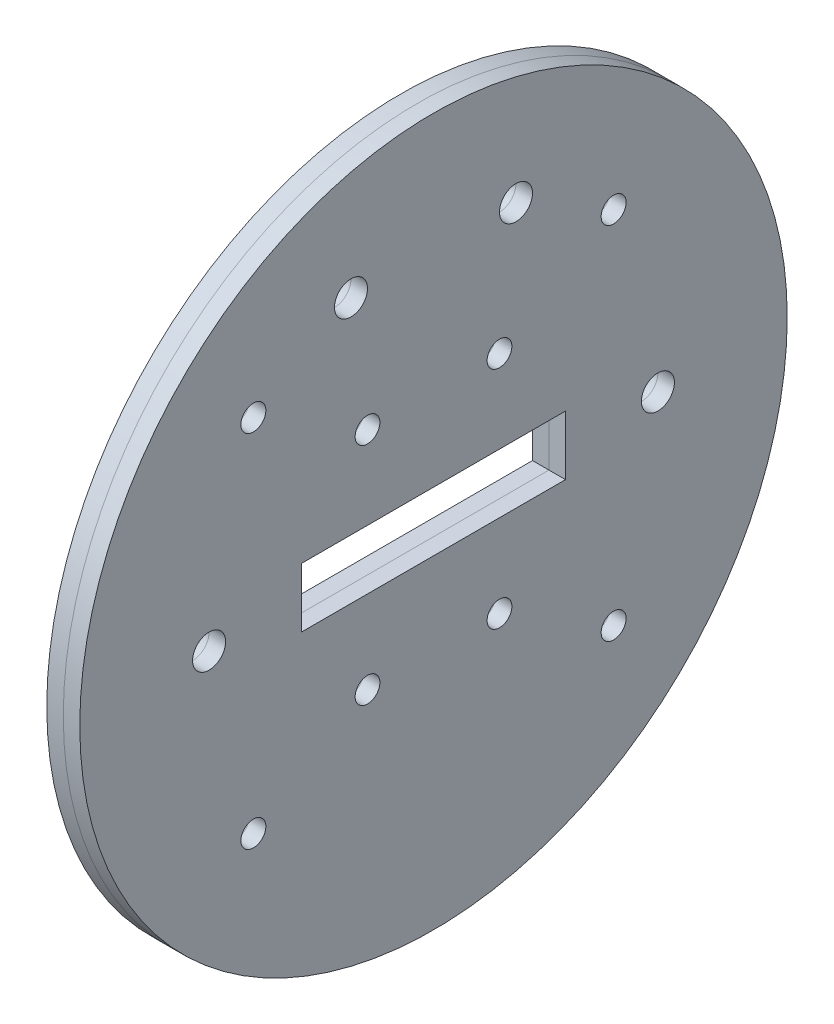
ISO-10303-21;
HEADER;
FILE_DESCRIPTION(('STEP AP214'),'2;1');
FILE_NAME('part.step','',(''),(''),'','','');
FILE_SCHEMA(('AUTOMOTIVE_DESIGN { 1 0 10303 214 1 1 1 1 }'));
ENDSEC;
DATA;
#1=APPLICATION_CONTEXT('core data for automotive mechanical design processes');
#2=APPLICATION_PROTOCOL_DEFINITION('international standard','automotive_design',2000,#1);
#3=PRODUCT_CONTEXT('',#1,'mechanical');
#4=PRODUCT('Part','Part','',(#3));
#5=PRODUCT_RELATED_PRODUCT_CATEGORY('part','',(#4));
#6=PRODUCT_DEFINITION_FORMATION('','',#4);
#7=PRODUCT_DEFINITION_CONTEXT('part definition',#1,'design');
#8=PRODUCT_DEFINITION('design','',#6,#7);
#9=PRODUCT_DEFINITION_SHAPE('','',#8);
#10=(LENGTH_UNIT() NAMED_UNIT(*) SI_UNIT(.MILLI.,.METRE.));
#11=(NAMED_UNIT(*) PLANE_ANGLE_UNIT() SI_UNIT($,.RADIAN.));
#12=(NAMED_UNIT(*) SI_UNIT($,.STERADIAN.) SOLID_ANGLE_UNIT());
#13=UNCERTAINTY_MEASURE_WITH_UNIT(LENGTH_MEASURE(1.E-05),#10,'distance_accuracy_value','');
#14=(GEOMETRIC_REPRESENTATION_CONTEXT(3) GLOBAL_UNCERTAINTY_ASSIGNED_CONTEXT((#13)) GLOBAL_UNIT_ASSIGNED_CONTEXT((#10,
#11,#12)) REPRESENTATION_CONTEXT('',''));
#15=CARTESIAN_POINT('',(0.,0.,0.));
#16=DIRECTION('',(0.,0.,1.));
#17=DIRECTION('',(1.,0.,0.));
#18=AXIS2_PLACEMENT_3D('',#15,#16,#17);
#19=CARTESIAN_POINT('',(6.35,0.,0.));
#20=DIRECTION('',(-1.,0.,0.));
#21=DIRECTION('',(0.,0.,1.));
#22=AXIS2_PLACEMENT_3D('',#19,#20,#21);
#23=CYLINDRICAL_SURFACE('',#22,68.072);
#24=CARTESIAN_POINT('',(6.35,0.,0.));
#25=DIRECTION('',(1.,0.,0.));
#26=DIRECTION('',(0.,0.,-1.));
#27=AXIS2_PLACEMENT_3D('',#24,#25,#26);
#28=CIRCLE('',#27,68.072);
#29=CARTESIAN_POINT('',(6.35,0.,-68.072));
#30=VERTEX_POINT('',#29);
#31=EDGE_CURVE('E140',#30,#30,#28,.T.);
#32=ORIENTED_EDGE('',*,*,#31,.F.);
#33=EDGE_LOOP('',(#32));
#34=FACE_BOUND('',#33,.T.);
#35=CARTESIAN_POINT('',(3.175,0.,0.));
#36=DIRECTION('',(1.,0.,0.));
#37=DIRECTION('',(0.,0.,-1.));
#38=AXIS2_PLACEMENT_3D('',#35,#36,#37);
#39=CIRCLE('',#38,68.072);
#40=CARTESIAN_POINT('',(3.175,0.,-68.072));
#41=VERTEX_POINT('',#40);
#42=EDGE_CURVE('E145',#41,#41,#39,.T.);
#43=ORIENTED_EDGE('',*,*,#42,.T.);
#44=EDGE_LOOP('',(#43));
#45=FACE_BOUND('',#44,.T.);
#46=ADVANCED_FACE('F53',(#34,#45),#23,.T.);
#47=CARTESIAN_POINT('',(6.35,0.,0.));
#48=DIRECTION('',(1.,0.,0.));
#49=DIRECTION('',(0.,0.,-1.));
#50=AXIS2_PLACEMENT_3D('',#47,#48,#49);
#51=PLANE('',#50);
#52=CARTESIAN_POINT('',(6.35,-34.6637886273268,34.6637886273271));
#53=DIRECTION('',(1.,0.,0.));
#54=DIRECTION('',(0.,0.,-1.));
#55=AXIS2_PLACEMENT_3D('',#52,#53,#54);
#56=CIRCLE('',#55,2.40029999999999);
#57=CARTESIAN_POINT('',(6.35,-34.6637886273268,32.2634886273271));
#58=VERTEX_POINT('',#57);
#59=EDGE_CURVE('E195',#58,#58,#56,.T.);
#60=ORIENTED_EDGE('',*,*,#59,.F.);
#61=EDGE_LOOP('',(#60));
#62=FACE_BOUND('',#61,.T.);
#63=CARTESIAN_POINT('',(6.35,34.6637886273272,34.6637886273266));
#64=DIRECTION('',(1.,0.,0.));
#65=DIRECTION('',(0.,0.,-1.));
#66=AXIS2_PLACEMENT_3D('',#63,#64,#65);
#67=CIRCLE('',#66,2.40029999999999);
#68=CARTESIAN_POINT('',(6.35,34.6637886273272,32.2634886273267));
#69=VERTEX_POINT('',#68);
#70=EDGE_CURVE('E242',#69,#69,#67,.T.);
#71=ORIENTED_EDGE('',*,*,#70,.F.);
#72=EDGE_LOOP('',(#71));
#73=FACE_BOUND('',#72,.T.);
#74=CARTESIAN_POINT('',(6.35,34.6637886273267,-34.6637886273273));
#75=DIRECTION('',(1.,0.,0.));
#76=DIRECTION('',(0.,0.,-1.));
#77=AXIS2_PLACEMENT_3D('',#74,#75,#76);
#78=CIRCLE('',#77,2.4003);
#79=CARTESIAN_POINT('',(6.35,34.6637886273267,-37.0640886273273));
#80=VERTEX_POINT('',#79);
#81=EDGE_CURVE('E238',#80,#80,#78,.T.);
#82=ORIENTED_EDGE('',*,*,#81,.F.);
#83=EDGE_LOOP('',(#82));
#84=FACE_BOUND('',#83,.T.);
#85=CARTESIAN_POINT('',(6.35,-34.6637886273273,-34.6637886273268));
#86=DIRECTION('',(1.,0.,0.));
#87=DIRECTION('',(0.,0.,-1.));
#88=AXIS2_PLACEMENT_3D('',#85,#86,#87);
#89=CIRCLE('',#88,2.4003);
#90=CARTESIAN_POINT('',(6.35,-34.6637886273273,-37.0640886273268));
#91=VERTEX_POINT('',#90);
#92=EDGE_CURVE('E234',#91,#91,#89,.T.);
#93=ORIENTED_EDGE('',*,*,#92,.F.);
#94=EDGE_LOOP('',(#93));
#95=FACE_BOUND('',#94,.T.);
#96=CARTESIAN_POINT('',(6.35,21.66874,12.7));
#97=DIRECTION('',(1.,0.,0.));
#98=DIRECTION('',(0.,0.,-1.));
#99=AXIS2_PLACEMENT_3D('',#96,#97,#98);
#100=CIRCLE('',#99,2.38125);
#101=CARTESIAN_POINT('',(6.35,21.66874,10.31875));
#102=VERTEX_POINT('',#101);
#103=EDGE_CURVE('E177',#102,#102,#100,.T.);
#104=ORIENTED_EDGE('',*,*,#103,.F.);
#105=EDGE_LOOP('',(#104));
#106=FACE_BOUND('',#105,.T.);
#107=CARTESIAN_POINT('',(6.35,21.66874,-12.7));
#108=DIRECTION('',(1.,0.,0.));
#109=DIRECTION('',(0.,0.,1.));
#110=AXIS2_PLACEMENT_3D('',#107,#108,#109);
#111=CIRCLE('',#110,2.38125);
#112=CARTESIAN_POINT('',(6.35,21.66874,-10.31875));
#113=VERTEX_POINT('',#112);
#114=EDGE_CURVE('E216',#113,#113,#111,.T.);
#115=ORIENTED_EDGE('',*,*,#114,.F.);
#116=EDGE_LOOP('',(#115));
#117=FACE_BOUND('',#116,.T.);
#118=CARTESIAN_POINT('',(6.35,-21.66874,-12.7));
#119=DIRECTION('',(1.,0.,0.));
#120=DIRECTION('',(0.,0.,-1.));
#121=AXIS2_PLACEMENT_3D('',#118,#119,#120);
#122=CIRCLE('',#121,2.38125);
#123=CARTESIAN_POINT('',(6.35,-21.66874,-15.08125));
#124=VERTEX_POINT('',#123);
#125=EDGE_CURVE('E210',#124,#124,#122,.T.);
#126=ORIENTED_EDGE('',*,*,#125,.F.);
#127=EDGE_LOOP('',(#126));
#128=FACE_BOUND('',#127,.T.);
#129=CARTESIAN_POINT('',(6.35,-21.66874,12.7));
#130=DIRECTION('',(1.,0.,0.));
#131=DIRECTION('',(0.,0.,1.));
#132=AXIS2_PLACEMENT_3D('',#129,#130,#131);
#133=CIRCLE('',#132,2.38125);
#134=CARTESIAN_POINT('',(6.35,-21.66874,15.08125));
#135=VERTEX_POINT('',#134);
#136=EDGE_CURVE('E205',#135,#135,#133,.T.);
#137=ORIENTED_EDGE('',*,*,#136,.F.);
#138=EDGE_LOOP('',(#137));
#139=FACE_BOUND('',#138,.T.);
#140=CARTESIAN_POINT('',(6.35,45.212,15.875));
#141=DIRECTION('',(1.,0.,0.));
#142=DIRECTION('',(0.,0.,-1.));
#143=AXIS2_PLACEMENT_3D('',#140,#141,#142);
#144=CIRCLE('',#143,3.175);
#145=CARTESIAN_POINT('',(6.35,45.212,12.7));
#146=VERTEX_POINT('',#145);
#147=EDGE_CURVE('E168',#146,#146,#144,.T.);
#148=ORIENTED_EDGE('',*,*,#147,.F.);
#149=EDGE_LOOP('',(#148));
#150=FACE_BOUND('',#149,.T.);
#151=CARTESIAN_POINT('',(6.35,45.212,-15.875));
#152=DIRECTION('',(1.,0.,0.));
#153=DIRECTION('',(0.,0.,1.));
#154=AXIS2_PLACEMENT_3D('',#151,#152,#153);
#155=CIRCLE('',#154,3.175);
#156=CARTESIAN_POINT('',(6.35,45.212,-12.7));
#157=VERTEX_POINT('',#156);
#158=EDGE_CURVE('E189',#157,#157,#155,.T.);
#159=ORIENTED_EDGE('',*,*,#158,.F.);
#160=EDGE_LOOP('',(#159));
#161=FACE_BOUND('',#160,.T.);
#162=DIRECTION('',(0.,1.,0.));
#163=VECTOR('',#162,1.);
#164=CARTESIAN_POINT('',(6.35,5.715,-25.4));
#165=LINE('',#164,#163);
#166=CARTESIAN_POINT('',(6.35,-5.715,-25.4));
#167=VERTEX_POINT('',#166);
#168=CARTESIAN_POINT('',(6.35,5.715,-25.4));
#169=VERTEX_POINT('',#168);
#170=EDGE_CURVE('E70',#167,#169,#165,.T.);
#171=ORIENTED_EDGE('',*,*,#170,.F.);
#172=DIRECTION('',(0.,0.,-1.));
#173=VECTOR('',#172,1.);
#174=CARTESIAN_POINT('',(6.35,-5.715,25.4));
#175=LINE('',#174,#173);
#176=CARTESIAN_POINT('',(6.35,-5.715,25.4));
#177=VERTEX_POINT('',#176);
#178=EDGE_CURVE('E117',#177,#167,#175,.T.);
#179=ORIENTED_EDGE('',*,*,#178,.F.);
#180=DIRECTION('',(0.,-1.,0.));
#181=VECTOR('',#180,1.);
#182=CARTESIAN_POINT('',(6.35,5.715,25.4));
#183=LINE('',#182,#181);
#184=CARTESIAN_POINT('',(6.35,5.715,25.4));
#185=VERTEX_POINT('',#184);
#186=EDGE_CURVE('E99',#185,#177,#183,.T.);
#187=ORIENTED_EDGE('',*,*,#186,.F.);
#188=DIRECTION('',(0.,0.,1.));
#189=VECTOR('',#188,1.);
#190=CARTESIAN_POINT('',(6.35,5.715,25.4));
#191=LINE('',#190,#189);
#192=EDGE_CURVE('E109',#169,#185,#191,.T.);
#193=ORIENTED_EDGE('',*,*,#192,.F.);
#194=EDGE_LOOP('',(#171,#179,#187,#193));
#195=FACE_BOUND('',#194,.T.);
#196=CARTESIAN_POINT('',(6.35,0.,-43.18));
#197=DIRECTION('',(1.,0.,0.));
#198=DIRECTION('',(0.,0.,-1.));
#199=AXIS2_PLACEMENT_3D('',#196,#197,#198);
#200=CIRCLE('',#199,3.175);
#201=CARTESIAN_POINT('',(6.35,0.,-46.355));
#202=VERTEX_POINT('',#201);
#203=EDGE_CURVE('E132',#202,#202,#200,.T.);
#204=ORIENTED_EDGE('',*,*,#203,.F.);
#205=EDGE_LOOP('',(#204));
#206=FACE_BOUND('',#205,.T.);
#207=CARTESIAN_POINT('',(6.35,0.,43.18));
#208=DIRECTION('',(1.,0.,0.));
#209=DIRECTION('',(0.,0.,1.));
#210=AXIS2_PLACEMENT_3D('',#207,#208,#209);
#211=CIRCLE('',#210,3.175);
#212=CARTESIAN_POINT('',(6.35,0.,46.355));
#213=VERTEX_POINT('',#212);
#214=EDGE_CURVE('E127',#213,#213,#211,.T.);
#215=ORIENTED_EDGE('',*,*,#214,.F.);
#216=EDGE_LOOP('',(#215));
#217=FACE_BOUND('',#216,.T.);
#218=ORIENTED_EDGE('',*,*,#31,.T.);
#219=EDGE_LOOP('',(#218));
#220=FACE_BOUND('',#219,.T.);
#221=ADVANCED_FACE('F114',(#62,#73,#84,#95,#106,#117,#128,#139,#150,#161,#195,#206,#217,#220),
#51,.T.);
#222=CARTESIAN_POINT('',(3.175,0.,0.));
#223=DIRECTION('',(1.,0.,0.));
#224=DIRECTION('',(0.,0.,-1.));
#225=AXIS2_PLACEMENT_3D('',#222,#223,#224);
#226=PLANE('',#225);
#227=CARTESIAN_POINT('',(3.175,-34.6637886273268,34.6637886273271));
#228=DIRECTION('',(1.,0.,0.));
#229=DIRECTION('',(0.,0.,-1.));
#230=AXIS2_PLACEMENT_3D('',#227,#228,#229);
#231=CIRCLE('',#230,2.40029999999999);
#232=CARTESIAN_POINT('',(3.175,-34.6637886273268,32.2634886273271));
#233=VERTEX_POINT('',#232);
#234=EDGE_CURVE('E56',#233,#233,#231,.T.);
#235=ORIENTED_EDGE('',*,*,#234,.T.);
#236=EDGE_LOOP('',(#235));
#237=FACE_BOUND('',#236,.T.);
#238=CARTESIAN_POINT('',(3.175,34.6637886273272,34.6637886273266));
#239=DIRECTION('',(1.,0.,0.));
#240=DIRECTION('',(0.,0.,-1.));
#241=AXIS2_PLACEMENT_3D('',#238,#239,#240);
#242=CIRCLE('',#241,2.40029999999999);
#243=CARTESIAN_POINT('',(3.175,34.6637886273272,32.2634886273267));
#244=VERTEX_POINT('',#243);
#245=EDGE_CURVE('E198',#244,#244,#242,.T.);
#246=ORIENTED_EDGE('',*,*,#245,.T.);
#247=EDGE_LOOP('',(#246));
#248=FACE_BOUND('',#247,.T.);
#249=CARTESIAN_POINT('',(3.175,34.6637886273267,-34.6637886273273));
#250=DIRECTION('',(1.,0.,0.));
#251=DIRECTION('',(0.,0.,-1.));
#252=AXIS2_PLACEMENT_3D('',#249,#250,#251);
#253=CIRCLE('',#252,2.4003);
#254=CARTESIAN_POINT('',(3.175,34.6637886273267,-37.0640886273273));
#255=VERTEX_POINT('',#254);
#256=EDGE_CURVE('E194',#255,#255,#253,.T.);
#257=ORIENTED_EDGE('',*,*,#256,.T.);
#258=EDGE_LOOP('',(#257));
#259=FACE_BOUND('',#258,.T.);
#260=CARTESIAN_POINT('',(3.175,-34.6637886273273,-34.6637886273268));
#261=DIRECTION('',(1.,0.,0.));
#262=DIRECTION('',(0.,0.,-1.));
#263=AXIS2_PLACEMENT_3D('',#260,#261,#262);
#264=CIRCLE('',#263,2.4003);
#265=CARTESIAN_POINT('',(3.175,-34.6637886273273,-37.0640886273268));
#266=VERTEX_POINT('',#265);
#267=EDGE_CURVE('E190',#266,#266,#264,.T.);
#268=ORIENTED_EDGE('',*,*,#267,.T.);
#269=EDGE_LOOP('',(#268));
#270=FACE_BOUND('',#269,.T.);
#271=CARTESIAN_POINT('',(3.175,21.66874,12.7));
#272=DIRECTION('',(1.,0.,0.));
#273=DIRECTION('',(0.,0.,-1.));
#274=AXIS2_PLACEMENT_3D('',#271,#272,#273);
#275=CIRCLE('',#274,2.38125);
#276=CARTESIAN_POINT('',(3.175,21.66874,10.31875));
#277=VERTEX_POINT('',#276);
#278=EDGE_CURVE('E185',#277,#277,#275,.T.);
#279=ORIENTED_EDGE('',*,*,#278,.T.);
#280=EDGE_LOOP('',(#279));
#281=FACE_BOUND('',#280,.T.);
#282=CARTESIAN_POINT('',(3.175,21.66874,-12.7));
#283=DIRECTION('',(1.,0.,0.));
#284=DIRECTION('',(0.,0.,-1.));
#285=AXIS2_PLACEMENT_3D('',#282,#283,#284);
#286=CIRCLE('',#285,2.38125);
#287=CARTESIAN_POINT('',(3.175,21.66874,-15.08125));
#288=VERTEX_POINT('',#287);
#289=EDGE_CURVE('E181',#288,#288,#286,.T.);
#290=ORIENTED_EDGE('',*,*,#289,.T.);
#291=EDGE_LOOP('',(#290));
#292=FACE_BOUND('',#291,.T.);
#293=CARTESIAN_POINT('',(3.175,-21.66874,-12.7));
#294=DIRECTION('',(1.,0.,0.));
#295=DIRECTION('',(0.,0.,-1.));
#296=AXIS2_PLACEMENT_3D('',#293,#294,#295);
#297=CIRCLE('',#296,2.38125);
#298=CARTESIAN_POINT('',(3.175,-21.66874,-15.08125));
#299=VERTEX_POINT('',#298);
#300=EDGE_CURVE('E176',#299,#299,#297,.T.);
#301=ORIENTED_EDGE('',*,*,#300,.T.);
#302=EDGE_LOOP('',(#301));
#303=FACE_BOUND('',#302,.T.);
#304=CARTESIAN_POINT('',(3.175,-21.66874,12.7));
#305=DIRECTION('',(1.,0.,0.));
#306=DIRECTION('',(0.,0.,-1.));
#307=AXIS2_PLACEMENT_3D('',#304,#305,#306);
#308=CIRCLE('',#307,2.38125);
#309=CARTESIAN_POINT('',(3.175,-21.66874,10.31875));
#310=VERTEX_POINT('',#309);
#311=EDGE_CURVE('E172',#310,#310,#308,.T.);
#312=ORIENTED_EDGE('',*,*,#311,.T.);
#313=EDGE_LOOP('',(#312));
#314=FACE_BOUND('',#313,.T.);
#315=CARTESIAN_POINT('',(3.175,45.212,15.875));
#316=DIRECTION('',(1.,0.,0.));
#317=DIRECTION('',(0.,0.,-1.));
#318=AXIS2_PLACEMENT_3D('',#315,#316,#317);
#319=CIRCLE('',#318,3.175);
#320=CARTESIAN_POINT('',(3.175,45.212,12.7));
#321=VERTEX_POINT('',#320);
#322=EDGE_CURVE('E167',#321,#321,#319,.T.);
#323=ORIENTED_EDGE('',*,*,#322,.T.);
#324=EDGE_LOOP('',(#323));
#325=FACE_BOUND('',#324,.T.);
#326=CARTESIAN_POINT('',(3.175,45.212,-15.875));
#327=DIRECTION('',(1.,0.,0.));
#328=DIRECTION('',(0.,0.,-1.));
#329=AXIS2_PLACEMENT_3D('',#326,#327,#328);
#330=CIRCLE('',#329,3.175);
#331=CARTESIAN_POINT('',(3.175,45.212,-19.05));
#332=VERTEX_POINT('',#331);
#333=EDGE_CURVE('E163',#332,#332,#330,.T.);
#334=ORIENTED_EDGE('',*,*,#333,.T.);
#335=EDGE_LOOP('',(#334));
#336=FACE_BOUND('',#335,.T.);
#337=DIRECTION('',(0.,0.,-1.));
#338=VECTOR('',#337,1.);
#339=CARTESIAN_POINT('',(3.175,-5.715,0.));
#340=LINE('',#339,#338);
#341=CARTESIAN_POINT('',(3.175,-5.715,25.4));
#342=VERTEX_POINT('',#341);
#343=CARTESIAN_POINT('',(3.175,-5.715,-25.4));
#344=VERTEX_POINT('',#343);
#345=EDGE_CURVE('E62',#342,#344,#340,.T.);
#346=ORIENTED_EDGE('',*,*,#345,.T.);
#347=DIRECTION('',(0.,1.,0.));
#348=VECTOR('',#347,1.);
#349=CARTESIAN_POINT('',(3.175,0.,-25.4));
#350=LINE('',#349,#348);
#351=CARTESIAN_POINT('',(3.175,5.715,-25.4));
#352=VERTEX_POINT('',#351);
#353=EDGE_CURVE('E12',#344,#352,#350,.T.);
#354=ORIENTED_EDGE('',*,*,#353,.T.);
#355=DIRECTION('',(0.,0.,1.));
#356=VECTOR('',#355,1.);
#357=CARTESIAN_POINT('',(3.175,5.715,0.));
#358=LINE('',#357,#356);
#359=CARTESIAN_POINT('',(3.175,5.715,25.4));
#360=VERTEX_POINT('',#359);
#361=EDGE_CURVE('E144',#352,#360,#358,.T.);
#362=ORIENTED_EDGE('',*,*,#361,.T.);
#363=DIRECTION('',(0.,-1.,0.));
#364=VECTOR('',#363,1.);
#365=CARTESIAN_POINT('',(3.175,0.,25.4));
#366=LINE('',#365,#364);
#367=EDGE_CURVE('E102',#360,#342,#366,.T.);
#368=ORIENTED_EDGE('',*,*,#367,.T.);
#369=EDGE_LOOP('',(#346,#354,#362,#368));
#370=FACE_BOUND('',#369,.T.);
#371=CARTESIAN_POINT('',(3.175,0.,-43.18));
#372=DIRECTION('',(1.,0.,0.));
#373=DIRECTION('',(0.,0.,-1.));
#374=AXIS2_PLACEMENT_3D('',#371,#372,#373);
#375=CIRCLE('',#374,3.175);
#376=CARTESIAN_POINT('',(3.175,0.,-46.355));
#377=VERTEX_POINT('',#376);
#378=EDGE_CURVE('E149',#377,#377,#375,.T.);
#379=ORIENTED_EDGE('',*,*,#378,.T.);
#380=EDGE_LOOP('',(#379));
#381=FACE_BOUND('',#380,.T.);
#382=CARTESIAN_POINT('',(3.175,0.,43.18));
#383=DIRECTION('',(1.,0.,0.));
#384=DIRECTION('',(0.,0.,-1.));
#385=AXIS2_PLACEMENT_3D('',#382,#383,#384);
#386=CIRCLE('',#385,3.175);
#387=CARTESIAN_POINT('',(3.175,0.,40.005));
#388=VERTEX_POINT('',#387);
#389=EDGE_CURVE('E136',#388,#388,#386,.T.);
#390=ORIENTED_EDGE('',*,*,#389,.T.);
#391=EDGE_LOOP('',(#390));
#392=FACE_BOUND('',#391,.T.);
#393=ORIENTED_EDGE('',*,*,#42,.F.);
#394=EDGE_LOOP('',(#393));
#395=FACE_BOUND('',#394,.T.);
#396=ADVANCED_FACE('F255',(#237,#248,#259,#270,#281,#292,#303,#314,#325,#336,#370,#381,#392,
#395),#226,.F.);
#397=CARTESIAN_POINT('',(0.,0.,43.18));
#398=DIRECTION('',(1.,0.,0.));
#399=DIRECTION('',(0.,0.,-1.));
#400=AXIS2_PLACEMENT_3D('',#397,#398,#399);
#401=CYLINDRICAL_SURFACE('',#400,3.175);
#402=ORIENTED_EDGE('',*,*,#214,.T.);
#403=EDGE_LOOP('',(#402));
#404=FACE_BOUND('',#403,.T.);
#405=ORIENTED_EDGE('',*,*,#389,.F.);
#406=EDGE_LOOP('',(#405));
#407=FACE_BOUND('',#406,.T.);
#408=ADVANCED_FACE('F282',(#404,#407),#401,.F.);
#409=CARTESIAN_POINT('',(0.,0.,-43.18));
#410=DIRECTION('',(1.,0.,0.));
#411=DIRECTION('',(0.,0.,-1.));
#412=AXIS2_PLACEMENT_3D('',#409,#410,#411);
#413=CYLINDRICAL_SURFACE('',#412,3.175);
#414=ORIENTED_EDGE('',*,*,#203,.T.);
#415=EDGE_LOOP('',(#414));
#416=FACE_BOUND('',#415,.T.);
#417=ORIENTED_EDGE('',*,*,#378,.F.);
#418=EDGE_LOOP('',(#417));
#419=FACE_BOUND('',#418,.T.);
#420=ADVANCED_FACE('F312',(#416,#419),#413,.F.);
#421=CARTESIAN_POINT('',(0.,5.715,-25.4));
#422=DIRECTION('',(0.,0.,-1.));
#423=DIRECTION('',(0.,1.,0.));
#424=AXIS2_PLACEMENT_3D('',#421,#422,#423);
#425=PLANE('',#424);
#426=DIRECTION('',(1.,0.,0.));
#427=VECTOR('',#426,1.);
#428=CARTESIAN_POINT('',(0.,-5.715,-25.4));
#429=LINE('',#428,#427);
#430=EDGE_CURVE('E124',#344,#167,#429,.T.);
#431=ORIENTED_EDGE('',*,*,#430,.T.);
#432=ORIENTED_EDGE('',*,*,#170,.T.);
#433=DIRECTION('',(1.,0.,0.));
#434=VECTOR('',#433,1.);
#435=CARTESIAN_POINT('',(0.,5.715,-25.4));
#436=LINE('',#435,#434);
#437=EDGE_CURVE('E106',#352,#169,#436,.T.);
#438=ORIENTED_EDGE('',*,*,#437,.F.);
#439=ORIENTED_EDGE('',*,*,#353,.F.);
#440=EDGE_LOOP('',(#431,#432,#438,#439));
#441=FACE_BOUND('',#440,.T.);
#442=ADVANCED_FACE('F320',(#441),#425,.F.);
#443=CARTESIAN_POINT('',(0.,-5.715,25.4));
#444=DIRECTION('',(0.,-1.,0.));
#445=DIRECTION('',(0.,0.,-1.));
#446=AXIS2_PLACEMENT_3D('',#443,#444,#445);
#447=PLANE('',#446);
#448=DIRECTION('',(1.,0.,0.));
#449=VECTOR('',#448,1.);
#450=CARTESIAN_POINT('',(0.,-5.715,25.4));
#451=LINE('',#450,#449);
#452=EDGE_CURVE('E105',#342,#177,#451,.T.);
#453=ORIENTED_EDGE('',*,*,#452,.T.);
#454=ORIENTED_EDGE('',*,*,#178,.T.);
#455=ORIENTED_EDGE('',*,*,#430,.F.);
#456=ORIENTED_EDGE('',*,*,#345,.F.);
#457=EDGE_LOOP('',(#453,#454,#455,#456));
#458=FACE_BOUND('',#457,.T.);
#459=ADVANCED_FACE('F328',(#458),#447,.F.);
#460=CARTESIAN_POINT('',(0.,5.715,25.4));
#461=DIRECTION('',(0.,0.,1.));
#462=DIRECTION('',(1.,0.,0.));
#463=AXIS2_PLACEMENT_3D('',#460,#461,#462);
#464=PLANE('',#463);
#465=DIRECTION('',(1.,0.,0.));
#466=VECTOR('',#465,1.);
#467=CARTESIAN_POINT('',(0.,5.715,25.4));
#468=LINE('',#467,#466);
#469=EDGE_CURVE('E78',#360,#185,#468,.T.);
#470=ORIENTED_EDGE('',*,*,#469,.T.);
#471=ORIENTED_EDGE('',*,*,#186,.T.);
#472=ORIENTED_EDGE('',*,*,#452,.F.);
#473=ORIENTED_EDGE('',*,*,#367,.F.);
#474=EDGE_LOOP('',(#470,#471,#472,#473));
#475=FACE_BOUND('',#474,.T.);
#476=ADVANCED_FACE('F96',(#475),#464,.F.);
#477=CARTESIAN_POINT('',(0.,5.715,25.4));
#478=DIRECTION('',(0.,1.,0.));
#479=DIRECTION('',(0.,0.,1.));
#480=AXIS2_PLACEMENT_3D('',#477,#478,#479);
#481=PLANE('',#480);
#482=ORIENTED_EDGE('',*,*,#437,.T.);
#483=ORIENTED_EDGE('',*,*,#192,.T.);
#484=ORIENTED_EDGE('',*,*,#469,.F.);
#485=ORIENTED_EDGE('',*,*,#361,.F.);
#486=EDGE_LOOP('',(#482,#483,#484,#485));
#487=FACE_BOUND('',#486,.T.);
#488=ADVANCED_FACE('F110',(#487),#481,.F.);
#489=CARTESIAN_POINT('',(0.,45.212,-15.875));
#490=DIRECTION('',(1.,0.,0.));
#491=DIRECTION('',(0.,0.,-1.));
#492=AXIS2_PLACEMENT_3D('',#489,#490,#491);
#493=CYLINDRICAL_SURFACE('',#492,3.175);
#494=ORIENTED_EDGE('',*,*,#158,.T.);
#495=EDGE_LOOP('',(#494));
#496=FACE_BOUND('',#495,.T.);
#497=ORIENTED_EDGE('',*,*,#333,.F.);
#498=EDGE_LOOP('',(#497));
#499=FACE_BOUND('',#498,.T.);
#500=ADVANCED_FACE('F273',(#496,#499),#493,.F.);
#501=CARTESIAN_POINT('',(0.,45.212,15.875));
#502=DIRECTION('',(1.,0.,0.));
#503=DIRECTION('',(0.,0.,-1.));
#504=AXIS2_PLACEMENT_3D('',#501,#502,#503);
#505=CYLINDRICAL_SURFACE('',#504,3.175);
#506=ORIENTED_EDGE('',*,*,#147,.T.);
#507=EDGE_LOOP('',(#506));
#508=FACE_BOUND('',#507,.T.);
#509=ORIENTED_EDGE('',*,*,#322,.F.);
#510=EDGE_LOOP('',(#509));
#511=FACE_BOUND('',#510,.T.);
#512=ADVANCED_FACE('F276',(#508,#511),#505,.F.);
#513=CARTESIAN_POINT('',(0.,-21.66874,12.7));
#514=DIRECTION('',(1.,0.,0.));
#515=DIRECTION('',(0.,0.,-1.));
#516=AXIS2_PLACEMENT_3D('',#513,#514,#515);
#517=CYLINDRICAL_SURFACE('',#516,2.38125);
#518=ORIENTED_EDGE('',*,*,#136,.T.);
#519=EDGE_LOOP('',(#518));
#520=FACE_BOUND('',#519,.T.);
#521=ORIENTED_EDGE('',*,*,#311,.F.);
#522=EDGE_LOOP('',(#521));
#523=FACE_BOUND('',#522,.T.);
#524=ADVANCED_FACE('F358',(#520,#523),#517,.F.);
#525=CARTESIAN_POINT('',(0.,-21.66874,-12.7));
#526=DIRECTION('',(1.,0.,0.));
#527=DIRECTION('',(0.,0.,-1.));
#528=AXIS2_PLACEMENT_3D('',#525,#526,#527);
#529=CYLINDRICAL_SURFACE('',#528,2.38125);
#530=ORIENTED_EDGE('',*,*,#125,.T.);
#531=EDGE_LOOP('',(#530));
#532=FACE_BOUND('',#531,.T.);
#533=ORIENTED_EDGE('',*,*,#300,.F.);
#534=EDGE_LOOP('',(#533));
#535=FACE_BOUND('',#534,.T.);
#536=ADVANCED_FACE('F366',(#532,#535),#529,.F.);
#537=CARTESIAN_POINT('',(0.,21.66874,-12.7));
#538=DIRECTION('',(1.,0.,0.));
#539=DIRECTION('',(0.,0.,-1.));
#540=AXIS2_PLACEMENT_3D('',#537,#538,#539);
#541=CYLINDRICAL_SURFACE('',#540,2.38125);
#542=ORIENTED_EDGE('',*,*,#114,.T.);
#543=EDGE_LOOP('',(#542));
#544=FACE_BOUND('',#543,.T.);
#545=ORIENTED_EDGE('',*,*,#289,.F.);
#546=EDGE_LOOP('',(#545));
#547=FACE_BOUND('',#546,.T.);
#548=ADVANCED_FACE('F373',(#544,#547),#541,.F.);
#549=CARTESIAN_POINT('',(0.,21.66874,12.7));
#550=DIRECTION('',(1.,0.,0.));
#551=DIRECTION('',(0.,0.,-1.));
#552=AXIS2_PLACEMENT_3D('',#549,#550,#551);
#553=CYLINDRICAL_SURFACE('',#552,2.38125);
#554=ORIENTED_EDGE('',*,*,#103,.T.);
#555=EDGE_LOOP('',(#554));
#556=FACE_BOUND('',#555,.T.);
#557=ORIENTED_EDGE('',*,*,#278,.F.);
#558=EDGE_LOOP('',(#557));
#559=FACE_BOUND('',#558,.T.);
#560=ADVANCED_FACE('F381',(#556,#559),#553,.F.);
#561=CARTESIAN_POINT('',(0.,-34.6637886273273,-34.6637886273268));
#562=DIRECTION('',(1.,0.,0.));
#563=DIRECTION('',(0.,0.,-1.));
#564=AXIS2_PLACEMENT_3D('',#561,#562,#563);
#565=CYLINDRICAL_SURFACE('',#564,2.4003);
#566=ORIENTED_EDGE('',*,*,#92,.T.);
#567=EDGE_LOOP('',(#566));
#568=FACE_BOUND('',#567,.T.);
#569=ORIENTED_EDGE('',*,*,#267,.F.);
#570=EDGE_LOOP('',(#569));
#571=FACE_BOUND('',#570,.T.);
#572=ADVANCED_FACE('F387',(#568,#571),#565,.F.);
#573=CARTESIAN_POINT('',(0.,34.6637886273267,-34.6637886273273));
#574=DIRECTION('',(1.,0.,0.));
#575=DIRECTION('',(0.,0.,-1.));
#576=AXIS2_PLACEMENT_3D('',#573,#574,#575);
#577=CYLINDRICAL_SURFACE('',#576,2.4003);
#578=ORIENTED_EDGE('',*,*,#81,.T.);
#579=EDGE_LOOP('',(#578));
#580=FACE_BOUND('',#579,.T.);
#581=ORIENTED_EDGE('',*,*,#256,.F.);
#582=EDGE_LOOP('',(#581));
#583=FACE_BOUND('',#582,.T.);
#584=ADVANCED_FACE('F394',(#580,#583),#577,.F.);
#585=CARTESIAN_POINT('',(0.,34.6637886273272,34.6637886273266));
#586=DIRECTION('',(1.,0.,0.));
#587=DIRECTION('',(0.,0.,-1.));
#588=AXIS2_PLACEMENT_3D('',#585,#586,#587);
#589=CYLINDRICAL_SURFACE('',#588,2.40029999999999);
#590=ORIENTED_EDGE('',*,*,#70,.T.);
#591=EDGE_LOOP('',(#590));
#592=FACE_BOUND('',#591,.T.);
#593=ORIENTED_EDGE('',*,*,#245,.F.);
#594=EDGE_LOOP('',(#593));
#595=FACE_BOUND('',#594,.T.);
#596=ADVANCED_FACE('F402',(#592,#595),#589,.F.);
#597=CARTESIAN_POINT('',(0.,-34.6637886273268,34.6637886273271));
#598=DIRECTION('',(1.,0.,0.));
#599=DIRECTION('',(0.,0.,-1.));
#600=AXIS2_PLACEMENT_3D('',#597,#598,#599);
#601=CYLINDRICAL_SURFACE('',#600,2.40029999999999);
#602=ORIENTED_EDGE('',*,*,#59,.T.);
#603=EDGE_LOOP('',(#602));
#604=FACE_BOUND('',#603,.T.);
#605=ORIENTED_EDGE('',*,*,#234,.F.);
#606=EDGE_LOOP('',(#605));
#607=FACE_BOUND('',#606,.T.);
#608=ADVANCED_FACE('F250',(#604,#607),#601,.F.);
#609=CLOSED_SHELL('',(#46,#221,#396,#408,#420,#442,#459,#476,#488,#500,#512,#524,#536,#548,#560,
#572,#584,#596,#608));
#610=MANIFOLD_SOLID_BREP('B2',#609);
#611=CARTESIAN_POINT('',(3.175,0.,0.));
#612=DIRECTION('',(-1.,0.,0.));
#613=DIRECTION('',(0.,0.,1.));
#614=AXIS2_PLACEMENT_3D('',#611,#612,#613);
#615=CYLINDRICAL_SURFACE('',#614,68.072);
#616=CARTESIAN_POINT('',(3.175,0.,0.));
#617=DIRECTION('',(1.,0.,0.));
#618=DIRECTION('',(0.,0.,-1.));
#619=AXIS2_PLACEMENT_3D('',#616,#617,#618);
#620=CIRCLE('',#619,68.072);
#621=CARTESIAN_POINT('',(3.175,0.,-68.072));
#622=VERTEX_POINT('',#621);
#623=EDGE_CURVE('E51',#622,#622,#620,.T.);
#624=ORIENTED_EDGE('',*,*,#623,.F.);
#625=EDGE_LOOP('',(#624));
#626=FACE_BOUND('',#625,.T.);
#627=CARTESIAN_POINT('',(0.,0.,0.));
#628=DIRECTION('',(1.,0.,0.));
#629=DIRECTION('',(0.,0.,-1.));
#630=AXIS2_PLACEMENT_3D('',#627,#628,#629);
#631=CIRCLE('',#630,68.072);
#632=CARTESIAN_POINT('',(0.,0.,-68.072));
#633=VERTEX_POINT('',#632);
#634=EDGE_CURVE('E529',#633,#633,#631,.T.);
#635=ORIENTED_EDGE('',*,*,#634,.T.);
#636=EDGE_LOOP('',(#635));
#637=FACE_BOUND('',#636,.T.);
#638=ADVANCED_FACE('F526',(#626,#637),#615,.T.);
#639=CARTESIAN_POINT('',(3.175,0.,0.));
#640=DIRECTION('',(1.,0.,0.));
#641=DIRECTION('',(0.,0.,-1.));
#642=AXIS2_PLACEMENT_3D('',#639,#640,#641);
#643=PLANE('',#642);
#644=CARTESIAN_POINT('',(3.175,-34.6637886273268,34.6637886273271));
#645=DIRECTION('',(1.,0.,0.));
#646=DIRECTION('',(0.,0.,-1.));
#647=AXIS2_PLACEMENT_3D('',#644,#645,#646);
#648=CIRCLE('',#647,2.40029999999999);
#649=CARTESIAN_POINT('',(3.175,-34.6637886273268,32.2634886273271));
#650=VERTEX_POINT('',#649);
#651=EDGE_CURVE('E886',#650,#650,#648,.T.);
#652=ORIENTED_EDGE('',*,*,#651,.F.);
#653=EDGE_LOOP('',(#652));
#654=FACE_BOUND('',#653,.T.);
#655=CARTESIAN_POINT('',(3.175,34.6637886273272,34.6637886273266));
#656=DIRECTION('',(1.,0.,0.));
#657=DIRECTION('',(0.,0.,-1.));
#658=AXIS2_PLACEMENT_3D('',#655,#656,#657);
#659=CIRCLE('',#658,2.40029999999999);
#660=CARTESIAN_POINT('',(3.175,34.6637886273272,32.2634886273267));
#661=VERTEX_POINT('',#660);
#662=EDGE_CURVE('E896',#661,#661,#659,.T.);
#663=ORIENTED_EDGE('',*,*,#662,.F.);
#664=EDGE_LOOP('',(#663));
#665=FACE_BOUND('',#664,.T.);
#666=CARTESIAN_POINT('',(3.175,34.6637886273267,-34.6637886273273));
#667=DIRECTION('',(1.,0.,0.));
#668=DIRECTION('',(0.,0.,-1.));
#669=AXIS2_PLACEMENT_3D('',#666,#667,#668);
#670=CIRCLE('',#669,2.4003);
#671=CARTESIAN_POINT('',(3.175,34.6637886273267,-37.0640886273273));
#672=VERTEX_POINT('',#671);
#673=EDGE_CURVE('E899',#672,#672,#670,.T.);
#674=ORIENTED_EDGE('',*,*,#673,.F.);
#675=EDGE_LOOP('',(#674));
#676=FACE_BOUND('',#675,.T.);
#677=CARTESIAN_POINT('',(3.175,-34.6637886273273,-34.6637886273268));
#678=DIRECTION('',(1.,0.,0.));
#679=DIRECTION('',(0.,0.,-1.));
#680=AXIS2_PLACEMENT_3D('',#677,#678,#679);
#681=CIRCLE('',#680,2.4003);
#682=CARTESIAN_POINT('',(3.175,-34.6637886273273,-37.0640886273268));
#683=VERTEX_POINT('',#682);
#684=EDGE_CURVE('E902',#683,#683,#681,.T.);
#685=ORIENTED_EDGE('',*,*,#684,.F.);
#686=EDGE_LOOP('',(#685));
#687=FACE_BOUND('',#686,.T.);
#688=CARTESIAN_POINT('',(3.175,21.66874,12.7));
#689=DIRECTION('',(1.,0.,0.));
#690=DIRECTION('',(0.,0.,-1.));
#691=AXIS2_PLACEMENT_3D('',#688,#689,#690);
#692=CIRCLE('',#691,2.38125);
#693=CARTESIAN_POINT('',(3.175,21.66874,10.31875));
#694=VERTEX_POINT('',#693);
#695=EDGE_CURVE('E865',#694,#694,#692,.T.);
#696=ORIENTED_EDGE('',*,*,#695,.F.);
#697=EDGE_LOOP('',(#696));
#698=FACE_BOUND('',#697,.T.);
#699=CARTESIAN_POINT('',(3.175,21.66874,-12.7));
#700=DIRECTION('',(1.,0.,0.));
#701=DIRECTION('',(0.,0.,-1.));
#702=AXIS2_PLACEMENT_3D('',#699,#700,#701);
#703=CIRCLE('',#702,2.38125);
#704=CARTESIAN_POINT('',(3.175,21.66874,-15.08125));
#705=VERTEX_POINT('',#704);
#706=EDGE_CURVE('E870',#705,#705,#703,.T.);
#707=ORIENTED_EDGE('',*,*,#706,.F.);
#708=EDGE_LOOP('',(#707));
#709=FACE_BOUND('',#708,.T.);
#710=CARTESIAN_POINT('',(3.175,-21.66874,-12.7));
#711=DIRECTION('',(1.,0.,0.));
#712=DIRECTION('',(0.,0.,-1.));
#713=AXIS2_PLACEMENT_3D('',#710,#711,#712);
#714=CIRCLE('',#713,2.38125);
#715=CARTESIAN_POINT('',(3.175,-21.66874,-15.08125));
#716=VERTEX_POINT('',#715);
#717=EDGE_CURVE('E875',#716,#716,#714,.T.);
#718=ORIENTED_EDGE('',*,*,#717,.F.);
#719=EDGE_LOOP('',(#718));
#720=FACE_BOUND('',#719,.T.);
#721=CARTESIAN_POINT('',(3.175,-21.66874,12.7));
#722=DIRECTION('',(1.,0.,0.));
#723=DIRECTION('',(0.,0.,-1.));
#724=AXIS2_PLACEMENT_3D('',#721,#722,#723);
#725=CIRCLE('',#724,2.38125);
#726=CARTESIAN_POINT('',(3.175,-21.66874,10.31875));
#727=VERTEX_POINT('',#726);
#728=EDGE_CURVE('E878',#727,#727,#725,.T.);
#729=ORIENTED_EDGE('',*,*,#728,.F.);
#730=EDGE_LOOP('',(#729));
#731=FACE_BOUND('',#730,.T.);
#732=CARTESIAN_POINT('',(3.175,45.212,15.875));
#733=DIRECTION('',(1.,0.,0.));
#734=DIRECTION('',(0.,0.,-1.));
#735=AXIS2_PLACEMENT_3D('',#732,#733,#734);
#736=CIRCLE('',#735,3.175);
#737=CARTESIAN_POINT('',(3.175,45.212,12.7));
#738=VERTEX_POINT('',#737);
#739=EDGE_CURVE('E585',#738,#738,#736,.T.);
#740=ORIENTED_EDGE('',*,*,#739,.F.);
#741=EDGE_LOOP('',(#740));
#742=FACE_BOUND('',#741,.T.);
#743=CARTESIAN_POINT('',(3.175,45.212,-15.875));
#744=DIRECTION('',(1.,0.,0.));
#745=DIRECTION('',(0.,0.,-1.));
#746=AXIS2_PLACEMENT_3D('',#743,#744,#745);
#747=CIRCLE('',#746,3.175);
#748=CARTESIAN_POINT('',(3.175,45.212,-19.05));
#749=VERTEX_POINT('',#748);
#750=EDGE_CURVE('E588',#749,#749,#747,.T.);
#751=ORIENTED_EDGE('',*,*,#750,.F.);
#752=EDGE_LOOP('',(#751));
#753=FACE_BOUND('',#752,.T.);
#754=DIRECTION('',(0.,1.,0.));
#755=VECTOR('',#754,1.);
#756=CARTESIAN_POINT('',(3.175,0.,-25.4));
#757=LINE('',#756,#755);
#758=CARTESIAN_POINT('',(3.175,-5.715,-25.4));
#759=VERTEX_POINT('',#758);
#760=CARTESIAN_POINT('',(3.175,5.715,-25.4));
#761=VERTEX_POINT('',#760);
#762=EDGE_CURVE('E572',#759,#761,#757,.T.);
#763=ORIENTED_EDGE('',*,*,#762,.F.);
#764=DIRECTION('',(0.,0.,-1.));
#765=VECTOR('',#764,1.);
#766=CARTESIAN_POINT('',(3.175,-5.715,0.));
#767=LINE('',#766,#765);
#768=CARTESIAN_POINT('',(3.175,-5.715,25.4));
#769=VERTEX_POINT('',#768);
#770=EDGE_CURVE('E604',#769,#759,#767,.T.);
#771=ORIENTED_EDGE('',*,*,#770,.F.);
#772=DIRECTION('',(0.,-1.,0.));
#773=VECTOR('',#772,1.);
#774=CARTESIAN_POINT('',(3.175,0.,25.4));
#775=LINE('',#774,#773);
#776=CARTESIAN_POINT('',(3.175,5.715,25.4));
#777=VERTEX_POINT('',#776);
#778=EDGE_CURVE('E602',#777,#769,#775,.T.);
#779=ORIENTED_EDGE('',*,*,#778,.F.);
#780=DIRECTION('',(0.,0.,1.));
#781=VECTOR('',#780,1.);
#782=CARTESIAN_POINT('',(3.175,5.715,0.));
#783=LINE('',#782,#781);
#784=EDGE_CURVE('E596',#761,#777,#783,.T.);
#785=ORIENTED_EDGE('',*,*,#784,.F.);
#786=EDGE_LOOP('',(#763,#771,#779,#785));
#787=FACE_BOUND('',#786,.T.);
#788=CARTESIAN_POINT('',(3.175,0.,-43.18));
#789=DIRECTION('',(1.,0.,0.));
#790=DIRECTION('',(0.,0.,-1.));
#791=AXIS2_PLACEMENT_3D('',#788,#789,#790);
#792=CIRCLE('',#791,3.175);
#793=CARTESIAN_POINT('',(3.175,0.,-46.355));
#794=VERTEX_POINT('',#793);
#795=EDGE_CURVE('E616',#794,#794,#792,.T.);
#796=ORIENTED_EDGE('',*,*,#795,.F.);
#797=EDGE_LOOP('',(#796));
#798=FACE_BOUND('',#797,.T.);
#799=CARTESIAN_POINT('',(3.175,0.,43.18));
#800=DIRECTION('',(1.,0.,0.));
#801=DIRECTION('',(0.,0.,-1.));
#802=AXIS2_PLACEMENT_3D('',#799,#800,#801);
#803=CIRCLE('',#802,3.175);
#804=CARTESIAN_POINT('',(3.175,0.,40.005));
#805=VERTEX_POINT('',#804);
#806=EDGE_CURVE('E611',#805,#805,#803,.T.);
#807=ORIENTED_EDGE('',*,*,#806,.F.);
#808=EDGE_LOOP('',(#807));
#809=FACE_BOUND('',#808,.T.);
#810=ORIENTED_EDGE('',*,*,#623,.T.);
#811=EDGE_LOOP('',(#810));
#812=FACE_BOUND('',#811,.T.);
#813=ADVANCED_FACE('F626',(#654,#665,#676,#687,#698,#709,#720,#731,#742,#753,#787,#798,#809,
#812),#643,.T.);
#814=CARTESIAN_POINT('',(0.,0.,0.));
#815=DIRECTION('',(1.,0.,0.));
#816=DIRECTION('',(0.,0.,-1.));
#817=AXIS2_PLACEMENT_3D('',#814,#815,#816);
#818=PLANE('',#817);
#819=CARTESIAN_POINT('',(0.,-34.6637886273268,34.6637886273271));
#820=DIRECTION('',(1.,0.,0.));
#821=DIRECTION('',(0.,0.,-1.));
#822=AXIS2_PLACEMENT_3D('',#819,#820,#821);
#823=CIRCLE('',#822,2.40029999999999);
#824=CARTESIAN_POINT('',(0.,-34.6637886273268,32.2634886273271));
#825=VERTEX_POINT('',#824);
#826=EDGE_CURVE('E905',#825,#825,#823,.T.);
#827=ORIENTED_EDGE('',*,*,#826,.T.);
#828=EDGE_LOOP('',(#827));
#829=FACE_BOUND('',#828,.T.);
#830=CARTESIAN_POINT('',(0.,34.6637886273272,34.6637886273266));
#831=DIRECTION('',(1.,0.,0.));
#832=DIRECTION('',(0.,0.,-1.));
#833=AXIS2_PLACEMENT_3D('',#830,#831,#832);
#834=CIRCLE('',#833,2.40029999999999);
#835=CARTESIAN_POINT('',(0.,34.6637886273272,32.2634886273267));
#836=VERTEX_POINT('',#835);
#837=EDGE_CURVE('E912',#836,#836,#834,.T.);
#838=ORIENTED_EDGE('',*,*,#837,.T.);
#839=EDGE_LOOP('',(#838));
#840=FACE_BOUND('',#839,.T.);
#841=CARTESIAN_POINT('',(0.,34.6637886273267,-34.6637886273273));
#842=DIRECTION('',(1.,0.,0.));
#843=DIRECTION('',(0.,0.,-1.));
#844=AXIS2_PLACEMENT_3D('',#841,#842,#843);
#845=CIRCLE('',#844,2.4003);
#846=CARTESIAN_POINT('',(0.,34.6637886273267,-37.0640886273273));
#847=VERTEX_POINT('',#846);
#848=EDGE_CURVE('E909',#847,#847,#845,.T.);
#849=ORIENTED_EDGE('',*,*,#848,.T.);
#850=EDGE_LOOP('',(#849));
#851=FACE_BOUND('',#850,.T.);
#852=CARTESIAN_POINT('',(0.,-34.6637886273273,-34.6637886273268));
#853=DIRECTION('',(1.,0.,0.));
#854=DIRECTION('',(0.,0.,-1.));
#855=AXIS2_PLACEMENT_3D('',#852,#853,#854);
#856=CIRCLE('',#855,2.4003);
#857=CARTESIAN_POINT('',(0.,-34.6637886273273,-37.0640886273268));
#858=VERTEX_POINT('',#857);
#859=EDGE_CURVE('E906',#858,#858,#856,.T.);
#860=ORIENTED_EDGE('',*,*,#859,.T.);
#861=EDGE_LOOP('',(#860));
#862=FACE_BOUND('',#861,.T.);
#863=CARTESIAN_POINT('',(0.,21.66874,12.7));
#864=DIRECTION('',(1.,0.,0.));
#865=DIRECTION('',(0.,0.,-1.));
#866=AXIS2_PLACEMENT_3D('',#863,#864,#865);
#867=CIRCLE('',#866,2.38125);
#868=CARTESIAN_POINT('',(0.,21.66874,10.31875));
#869=VERTEX_POINT('',#868);
#870=EDGE_CURVE('E881',#869,#869,#867,.T.);
#871=ORIENTED_EDGE('',*,*,#870,.T.);
#872=EDGE_LOOP('',(#871));
#873=FACE_BOUND('',#872,.T.);
#874=CARTESIAN_POINT('',(0.,21.66874,-12.7));
#875=DIRECTION('',(1.,0.,0.));
#876=DIRECTION('',(0.,0.,1.));
#877=AXIS2_PLACEMENT_3D('',#874,#875,#876);
#878=CIRCLE('',#877,2.38125);
#879=CARTESIAN_POINT('',(0.,21.66874,-10.31875));
#880=VERTEX_POINT('',#879);
#881=EDGE_CURVE('E889',#880,#880,#878,.T.);
#882=ORIENTED_EDGE('',*,*,#881,.T.);
#883=EDGE_LOOP('',(#882));
#884=FACE_BOUND('',#883,.T.);
#885=CARTESIAN_POINT('',(0.,-21.66874,-12.7));
#886=DIRECTION('',(1.,0.,0.));
#887=DIRECTION('',(0.,0.,-1.));
#888=AXIS2_PLACEMENT_3D('',#885,#886,#887);
#889=CIRCLE('',#888,2.38125);
#890=CARTESIAN_POINT('',(0.,-21.66874,-15.08125));
#891=VERTEX_POINT('',#890);
#892=EDGE_CURVE('E885',#891,#891,#889,.T.);
#893=ORIENTED_EDGE('',*,*,#892,.T.);
#894=EDGE_LOOP('',(#893));
#895=FACE_BOUND('',#894,.T.);
#896=CARTESIAN_POINT('',(0.,-21.66874,12.7));
#897=DIRECTION('',(1.,0.,0.));
#898=DIRECTION('',(0.,0.,1.));
#899=AXIS2_PLACEMENT_3D('',#896,#897,#898);
#900=CIRCLE('',#899,2.38125);
#901=CARTESIAN_POINT('',(0.,-21.66874,15.08125));
#902=VERTEX_POINT('',#901);
#903=EDGE_CURVE('E882',#902,#902,#900,.T.);
#904=ORIENTED_EDGE('',*,*,#903,.T.);
#905=EDGE_LOOP('',(#904));
#906=FACE_BOUND('',#905,.T.);
#907=CARTESIAN_POINT('',(0.,45.212,15.875));
#908=DIRECTION('',(1.,0.,0.));
#909=DIRECTION('',(0.,0.,-1.));
#910=AXIS2_PLACEMENT_3D('',#907,#908,#909);
#911=CIRCLE('',#910,3.175);
#912=CARTESIAN_POINT('',(0.,45.212,12.7));
#913=VERTEX_POINT('',#912);
#914=EDGE_CURVE('E864',#913,#913,#911,.T.);
#915=ORIENTED_EDGE('',*,*,#914,.T.);
#916=EDGE_LOOP('',(#915));
#917=FACE_BOUND('',#916,.T.);
#918=CARTESIAN_POINT('',(0.,45.212,-15.875));
#919=DIRECTION('',(1.,0.,0.));
#920=DIRECTION('',(0.,0.,1.));
#921=AXIS2_PLACEMENT_3D('',#918,#919,#920);
#922=CIRCLE('',#921,3.175);
#923=CARTESIAN_POINT('',(0.,45.212,-12.7));
#924=VERTEX_POINT('',#923);
#925=EDGE_CURVE('E862',#924,#924,#922,.T.);
#926=ORIENTED_EDGE('',*,*,#925,.T.);
#927=EDGE_LOOP('',(#926));
#928=FACE_BOUND('',#927,.T.);
#929=DIRECTION('',(0.,0.,-1.));
#930=VECTOR('',#929,1.);
#931=CARTESIAN_POINT('',(0.,-5.715,25.4));
#932=LINE('',#931,#930);
#933=CARTESIAN_POINT('',(0.,-5.715,25.4));
#934=VERTEX_POINT('',#933);
#935=CARTESIAN_POINT('',(0.,-5.715,-25.4));
#936=VERTEX_POINT('',#935);
#937=EDGE_CURVE('E575',#934,#936,#932,.T.);
#938=ORIENTED_EDGE('',*,*,#937,.T.);
#939=DIRECTION('',(0.,1.,0.));
#940=VECTOR('',#939,1.);
#941=CARTESIAN_POINT('',(0.,5.715,-25.4));
#942=LINE('',#941,#940);
#943=CARTESIAN_POINT('',(0.,5.715,-25.4));
#944=VERTEX_POINT('',#943);
#945=EDGE_CURVE('E569',#936,#944,#942,.T.);
#946=ORIENTED_EDGE('',*,*,#945,.T.);
#947=DIRECTION('',(0.,0.,1.));
#948=VECTOR('',#947,1.);
#949=CARTESIAN_POINT('',(0.,5.715,25.4));
#950=LINE('',#949,#948);
#951=CARTESIAN_POINT('',(0.,5.715,25.4));
#952=VERTEX_POINT('',#951);
#953=EDGE_CURVE('E578',#944,#952,#950,.T.);
#954=ORIENTED_EDGE('',*,*,#953,.T.);
#955=DIRECTION('',(0.,-1.,0.));
#956=VECTOR('',#955,1.);
#957=CARTESIAN_POINT('',(0.,5.715,25.4));
#958=LINE('',#957,#956);
#959=EDGE_CURVE('E548',#952,#934,#958,.T.);
#960=ORIENTED_EDGE('',*,*,#959,.T.);
#961=EDGE_LOOP('',(#938,#946,#954,#960));
#962=FACE_BOUND('',#961,.T.);
#963=CARTESIAN_POINT('',(0.,0.,-43.18));
#964=DIRECTION('',(1.,0.,0.));
#965=DIRECTION('',(0.,0.,-1.));
#966=AXIS2_PLACEMENT_3D('',#963,#964,#965);
#967=CIRCLE('',#966,3.175);
#968=CARTESIAN_POINT('',(0.,0.,-46.355));
#969=VERTEX_POINT('',#968);
#970=EDGE_CURVE('E608',#969,#969,#967,.T.);
#971=ORIENTED_EDGE('',*,*,#970,.T.);
#972=EDGE_LOOP('',(#971));
#973=FACE_BOUND('',#972,.T.);
#974=CARTESIAN_POINT('',(0.,0.,43.18));
#975=DIRECTION('',(1.,0.,0.));
#976=DIRECTION('',(0.,0.,1.));
#977=AXIS2_PLACEMENT_3D('',#974,#975,#976);
#978=CIRCLE('',#977,3.175);
#979=CARTESIAN_POINT('',(0.,0.,46.355));
#980=VERTEX_POINT('',#979);
#981=EDGE_CURVE('E607',#980,#980,#978,.T.);
#982=ORIENTED_EDGE('',*,*,#981,.T.);
#983=EDGE_LOOP('',(#982));
#984=FACE_BOUND('',#983,.T.);
#985=ORIENTED_EDGE('',*,*,#634,.F.);
#986=EDGE_LOOP('',(#985));
#987=FACE_BOUND('',#986,.T.);
#988=ADVANCED_FACE('F582',(#829,#840,#851,#862,#873,#884,#895,#906,#917,#928,#962,#973,#984,
#987),#818,.F.);
#989=CARTESIAN_POINT('',(0.,0.,43.18));
#990=DIRECTION('',(1.,0.,0.));
#991=DIRECTION('',(0.,0.,-1.));
#992=AXIS2_PLACEMENT_3D('',#989,#990,#991);
#993=CYLINDRICAL_SURFACE('',#992,3.175);
#994=ORIENTED_EDGE('',*,*,#806,.T.);
#995=EDGE_LOOP('',(#994));
#996=FACE_BOUND('',#995,.T.);
#997=ORIENTED_EDGE('',*,*,#981,.F.);
#998=EDGE_LOOP('',(#997));
#999=FACE_BOUND('',#998,.T.);
#1000=ADVANCED_FACE('F625',(#996,#999),#993,.F.);
#1001=CARTESIAN_POINT('',(0.,0.,-43.18));
#1002=DIRECTION('',(1.,0.,0.));
#1003=DIRECTION('',(0.,0.,-1.));
#1004=AXIS2_PLACEMENT_3D('',#1001,#1002,#1003);
#1005=CYLINDRICAL_SURFACE('',#1004,3.175);
#1006=ORIENTED_EDGE('',*,*,#795,.T.);
#1007=EDGE_LOOP('',(#1006));
#1008=FACE_BOUND('',#1007,.T.);
#1009=ORIENTED_EDGE('',*,*,#970,.F.);
#1010=EDGE_LOOP('',(#1009));
#1011=FACE_BOUND('',#1010,.T.);
#1012=ADVANCED_FACE('F632',(#1008,#1011),#1005,.F.);
#1013=CARTESIAN_POINT('',(0.,5.715,-25.4));
#1014=DIRECTION('',(0.,0.,-1.));
#1015=DIRECTION('',(0.,1.,0.));
#1016=AXIS2_PLACEMENT_3D('',#1013,#1014,#1015);
#1017=PLANE('',#1016);
#1018=ORIENTED_EDGE('',*,*,#762,.T.);
#1019=DIRECTION('',(1.,0.,0.));
#1020=VECTOR('',#1019,1.);
#1021=CARTESIAN_POINT('',(0.,5.715,-25.4));
#1022=LINE('',#1021,#1020);
#1023=EDGE_CURVE('E540',#944,#761,#1022,.T.);
#1024=ORIENTED_EDGE('',*,*,#1023,.F.);
#1025=ORIENTED_EDGE('',*,*,#945,.F.);
#1026=DIRECTION('',(1.,0.,0.));
#1027=VECTOR('',#1026,1.);
#1028=CARTESIAN_POINT('',(0.,-5.715,-25.4));
#1029=LINE('',#1028,#1027);
#1030=EDGE_CURVE('E594',#936,#759,#1029,.T.);
#1031=ORIENTED_EDGE('',*,*,#1030,.T.);
#1032=EDGE_LOOP('',(#1018,#1024,#1025,#1031));
#1033=FACE_BOUND('',#1032,.T.);
#1034=ADVANCED_FACE('F566',(#1033),#1017,.F.);
#1035=CARTESIAN_POINT('',(0.,-5.715,25.4));
#1036=DIRECTION('',(0.,-1.,0.));
#1037=DIRECTION('',(0.,0.,-1.));
#1038=AXIS2_PLACEMENT_3D('',#1035,#1036,#1037);
#1039=PLANE('',#1038);
#1040=ORIENTED_EDGE('',*,*,#770,.T.);
#1041=ORIENTED_EDGE('',*,*,#1030,.F.);
#1042=ORIENTED_EDGE('',*,*,#937,.F.);
#1043=DIRECTION('',(1.,0.,0.));
#1044=VECTOR('',#1043,1.);
#1045=CARTESIAN_POINT('',(0.,-5.715,25.4));
#1046=LINE('',#1045,#1044);
#1047=EDGE_CURVE('E597',#934,#769,#1046,.T.);
#1048=ORIENTED_EDGE('',*,*,#1047,.T.);
#1049=EDGE_LOOP('',(#1040,#1041,#1042,#1048));
#1050=FACE_BOUND('',#1049,.T.);
#1051=ADVANCED_FACE('F784',(#1050),#1039,.F.);
#1052=CARTESIAN_POINT('',(0.,5.715,25.4));
#1053=DIRECTION('',(0.,0.,1.));
#1054=DIRECTION('',(1.,0.,0.));
#1055=AXIS2_PLACEMENT_3D('',#1052,#1053,#1054);
#1056=PLANE('',#1055);
#1057=ORIENTED_EDGE('',*,*,#778,.T.);
#1058=ORIENTED_EDGE('',*,*,#1047,.F.);
#1059=ORIENTED_EDGE('',*,*,#959,.F.);
#1060=DIRECTION('',(1.,0.,0.));
#1061=VECTOR('',#1060,1.);
#1062=CARTESIAN_POINT('',(0.,5.715,25.4));
#1063=LINE('',#1062,#1061);
#1064=EDGE_CURVE('E574',#952,#777,#1063,.T.);
#1065=ORIENTED_EDGE('',*,*,#1064,.T.);
#1066=EDGE_LOOP('',(#1057,#1058,#1059,#1065));
#1067=FACE_BOUND('',#1066,.T.);
#1068=ADVANCED_FACE('F775',(#1067),#1056,.F.);
#1069=CARTESIAN_POINT('',(0.,5.715,25.4));
#1070=DIRECTION('',(0.,1.,0.));
#1071=DIRECTION('',(0.,0.,1.));
#1072=AXIS2_PLACEMENT_3D('',#1069,#1070,#1071);
#1073=PLANE('',#1072);
#1074=ORIENTED_EDGE('',*,*,#784,.T.);
#1075=ORIENTED_EDGE('',*,*,#1064,.F.);
#1076=ORIENTED_EDGE('',*,*,#953,.F.);
#1077=ORIENTED_EDGE('',*,*,#1023,.T.);
#1078=EDGE_LOOP('',(#1074,#1075,#1076,#1077));
#1079=FACE_BOUND('',#1078,.T.);
#1080=ADVANCED_FACE('F579',(#1079),#1073,.F.);
#1081=CARTESIAN_POINT('',(0.,45.212,-15.875));
#1082=DIRECTION('',(1.,0.,0.));
#1083=DIRECTION('',(0.,0.,-1.));
#1084=AXIS2_PLACEMENT_3D('',#1081,#1082,#1083);
#1085=CYLINDRICAL_SURFACE('',#1084,3.175);
#1086=ORIENTED_EDGE('',*,*,#750,.T.);
#1087=EDGE_LOOP('',(#1086));
#1088=FACE_BOUND('',#1087,.T.);
#1089=ORIENTED_EDGE('',*,*,#925,.F.);
#1090=EDGE_LOOP('',(#1089));
#1091=FACE_BOUND('',#1090,.T.);
#1092=ADVANCED_FACE('F756',(#1088,#1091),#1085,.F.);
#1093=CARTESIAN_POINT('',(0.,45.212,15.875));
#1094=DIRECTION('',(1.,0.,0.));
#1095=DIRECTION('',(0.,0.,-1.));
#1096=AXIS2_PLACEMENT_3D('',#1093,#1094,#1095);
#1097=CYLINDRICAL_SURFACE('',#1096,3.175);
#1098=ORIENTED_EDGE('',*,*,#739,.T.);
#1099=EDGE_LOOP('',(#1098));
#1100=FACE_BOUND('',#1099,.T.);
#1101=ORIENTED_EDGE('',*,*,#914,.F.);
#1102=EDGE_LOOP('',(#1101));
#1103=FACE_BOUND('',#1102,.T.);
#1104=ADVANCED_FACE('F746',(#1100,#1103),#1097,.F.);
#1105=CARTESIAN_POINT('',(0.,-21.66874,12.7));
#1106=DIRECTION('',(1.,0.,0.));
#1107=DIRECTION('',(0.,0.,-1.));
#1108=AXIS2_PLACEMENT_3D('',#1105,#1106,#1107);
#1109=CYLINDRICAL_SURFACE('',#1108,2.38125);
#1110=ORIENTED_EDGE('',*,*,#728,.T.);
#1111=EDGE_LOOP('',(#1110));
#1112=FACE_BOUND('',#1111,.T.);
#1113=ORIENTED_EDGE('',*,*,#903,.F.);
#1114=EDGE_LOOP('',(#1113));
#1115=FACE_BOUND('',#1114,.T.);
#1116=ADVANCED_FACE('F736',(#1112,#1115),#1109,.F.);
#1117=CARTESIAN_POINT('',(0.,-21.66874,-12.7));
#1118=DIRECTION('',(1.,0.,0.));
#1119=DIRECTION('',(0.,0.,-1.));
#1120=AXIS2_PLACEMENT_3D('',#1117,#1118,#1119);
#1121=CYLINDRICAL_SURFACE('',#1120,2.38125);
#1122=ORIENTED_EDGE('',*,*,#717,.T.);
#1123=EDGE_LOOP('',(#1122));
#1124=FACE_BOUND('',#1123,.T.);
#1125=ORIENTED_EDGE('',*,*,#892,.F.);
#1126=EDGE_LOOP('',(#1125));
#1127=FACE_BOUND('',#1126,.T.);
#1128=ADVANCED_FACE('F727',(#1124,#1127),#1121,.F.);
#1129=CARTESIAN_POINT('',(0.,21.66874,-12.7));
#1130=DIRECTION('',(1.,0.,0.));
#1131=DIRECTION('',(0.,0.,-1.));
#1132=AXIS2_PLACEMENT_3D('',#1129,#1130,#1131);
#1133=CYLINDRICAL_SURFACE('',#1132,2.38125);
#1134=ORIENTED_EDGE('',*,*,#706,.T.);
#1135=EDGE_LOOP('',(#1134));
#1136=FACE_BOUND('',#1135,.T.);
#1137=ORIENTED_EDGE('',*,*,#881,.F.);
#1138=EDGE_LOOP('',(#1137));
#1139=FACE_BOUND('',#1138,.T.);
#1140=ADVANCED_FACE('F718',(#1136,#1139),#1133,.F.);
#1141=CARTESIAN_POINT('',(0.,21.66874,12.7));
#1142=DIRECTION('',(1.,0.,0.));
#1143=DIRECTION('',(0.,0.,-1.));
#1144=AXIS2_PLACEMENT_3D('',#1141,#1142,#1143);
#1145=CYLINDRICAL_SURFACE('',#1144,2.38125);
#1146=ORIENTED_EDGE('',*,*,#695,.T.);
#1147=EDGE_LOOP('',(#1146));
#1148=FACE_BOUND('',#1147,.T.);
#1149=ORIENTED_EDGE('',*,*,#870,.F.);
#1150=EDGE_LOOP('',(#1149));
#1151=FACE_BOUND('',#1150,.T.);
#1152=ADVANCED_FACE('F657',(#1148,#1151),#1145,.F.);
#1153=CARTESIAN_POINT('',(0.,-34.6637886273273,-34.6637886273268));
#1154=DIRECTION('',(1.,0.,0.));
#1155=DIRECTION('',(0.,0.,-1.));
#1156=AXIS2_PLACEMENT_3D('',#1153,#1154,#1155);
#1157=CYLINDRICAL_SURFACE('',#1156,2.4003);
#1158=ORIENTED_EDGE('',*,*,#684,.T.);
#1159=EDGE_LOOP('',(#1158));
#1160=FACE_BOUND('',#1159,.T.);
#1161=ORIENTED_EDGE('',*,*,#859,.F.);
#1162=EDGE_LOOP('',(#1161));
#1163=FACE_BOUND('',#1162,.T.);
#1164=ADVANCED_FACE('F668',(#1160,#1163),#1157,.F.);
#1165=CARTESIAN_POINT('',(0.,34.6637886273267,-34.6637886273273));
#1166=DIRECTION('',(1.,0.,0.));
#1167=DIRECTION('',(0.,0.,-1.));
#1168=AXIS2_PLACEMENT_3D('',#1165,#1166,#1167);
#1169=CYLINDRICAL_SURFACE('',#1168,2.4003);
#1170=ORIENTED_EDGE('',*,*,#673,.T.);
#1171=EDGE_LOOP('',(#1170));
#1172=FACE_BOUND('',#1171,.T.);
#1173=ORIENTED_EDGE('',*,*,#848,.F.);
#1174=EDGE_LOOP('',(#1173));
#1175=FACE_BOUND('',#1174,.T.);
#1176=ADVANCED_FACE('F673',(#1172,#1175),#1169,.F.);
#1177=CARTESIAN_POINT('',(0.,34.6637886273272,34.6637886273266));
#1178=DIRECTION('',(1.,0.,0.));
#1179=DIRECTION('',(0.,0.,-1.));
#1180=AXIS2_PLACEMENT_3D('',#1177,#1178,#1179);
#1181=CYLINDRICAL_SURFACE('',#1180,2.40029999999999);
#1182=ORIENTED_EDGE('',*,*,#662,.T.);
#1183=EDGE_LOOP('',(#1182));
#1184=FACE_BOUND('',#1183,.T.);
#1185=ORIENTED_EDGE('',*,*,#837,.F.);
#1186=EDGE_LOOP('',(#1185));
#1187=FACE_BOUND('',#1186,.T.);
#1188=ADVANCED_FACE('F684',(#1184,#1187),#1181,.F.);
#1189=CARTESIAN_POINT('',(0.,-34.6637886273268,34.6637886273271));
#1190=DIRECTION('',(1.,0.,0.));
#1191=DIRECTION('',(0.,0.,-1.));
#1192=AXIS2_PLACEMENT_3D('',#1189,#1190,#1191);
#1193=CYLINDRICAL_SURFACE('',#1192,2.40029999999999);
#1194=ORIENTED_EDGE('',*,*,#651,.T.);
#1195=EDGE_LOOP('',(#1194));
#1196=FACE_BOUND('',#1195,.T.);
#1197=ORIENTED_EDGE('',*,*,#826,.F.);
#1198=EDGE_LOOP('',(#1197));
#1199=FACE_BOUND('',#1198,.T.);
#1200=ADVANCED_FACE('F695',(#1196,#1199),#1193,.F.);
#1201=CLOSED_SHELL('',(#638,#813,#988,#1000,#1012,#1034,#1051,#1068,#1080,#1092,#1104,#1116,
#1128,#1140,#1152,#1164,#1176,#1188,#1200));
#1202=MANIFOLD_SOLID_BREP('B6',#1201);
#1203=ADVANCED_BREP_SHAPE_REPRESENTATION('',(#18,#610,#1202),#14);
#1204=SHAPE_DEFINITION_REPRESENTATION(#9,#1203);
ENDSEC;
END-ISO-10303-21;
